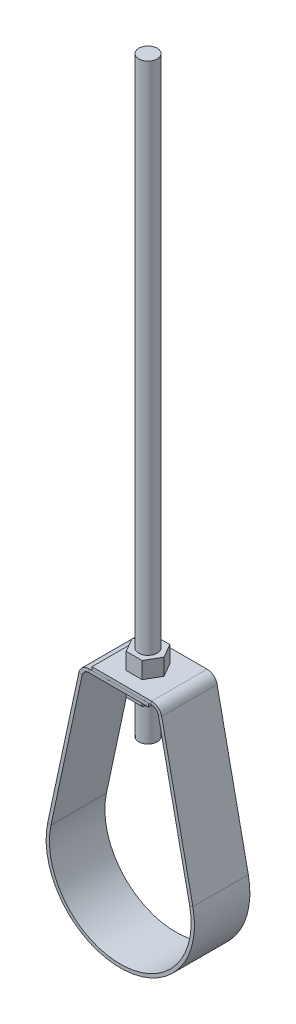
ISO-10303-21;
HEADER;
FILE_DESCRIPTION(('STEP AP214'),'2;1');
FILE_NAME('part.step','',(''),(''),'','','');
FILE_SCHEMA(('AUTOMOTIVE_DESIGN { 1 0 10303 214 1 1 1 1 }'));
ENDSEC;
DATA;
#1=APPLICATION_CONTEXT('core data for automotive mechanical design processes');
#2=APPLICATION_PROTOCOL_DEFINITION('international standard','automotive_design',2000,#1);
#3=PRODUCT_CONTEXT('',#1,'mechanical');
#4=PRODUCT('Part','Part','',(#3));
#5=PRODUCT_RELATED_PRODUCT_CATEGORY('part','',(#4));
#6=PRODUCT_DEFINITION_FORMATION('','',#4);
#7=PRODUCT_DEFINITION_CONTEXT('part definition',#1,'design');
#8=PRODUCT_DEFINITION('design','',#6,#7);
#9=PRODUCT_DEFINITION_SHAPE('','',#8);
#10=(LENGTH_UNIT() NAMED_UNIT(*) SI_UNIT(.MILLI.,.METRE.));
#11=(NAMED_UNIT(*) PLANE_ANGLE_UNIT() SI_UNIT($,.RADIAN.));
#12=(NAMED_UNIT(*) SI_UNIT($,.STERADIAN.) SOLID_ANGLE_UNIT());
#13=UNCERTAINTY_MEASURE_WITH_UNIT(LENGTH_MEASURE(1.E-05),#10,'distance_accuracy_value','');
#14=(GEOMETRIC_REPRESENTATION_CONTEXT(3) GLOBAL_UNCERTAINTY_ASSIGNED_CONTEXT((#13)) GLOBAL_UNIT_ASSIGNED_CONTEXT((#10,
#11,#12)) REPRESENTATION_CONTEXT('',''));
#15=CARTESIAN_POINT('',(0.,0.,0.));
#16=DIRECTION('',(0.,0.,1.));
#17=DIRECTION('',(1.,0.,0.));
#18=AXIS2_PLACEMENT_3D('',#15,#16,#17);
#19=CARTESIAN_POINT('',(0.,362.66628,0.));
#20=DIRECTION('',(0.,1.,0.));
#21=DIRECTION('',(0.,0.,1.));
#22=AXIS2_PLACEMENT_3D('',#19,#20,#21);
#23=PLANE('',#22);
#24=CARTESIAN_POINT('',(0.,362.66628,0.));
#25=DIRECTION('',(0.,-1.,0.));
#26=DIRECTION('',(0.,0.,-1.));
#27=AXIS2_PLACEMENT_3D('',#24,#25,#26);
#28=CIRCLE('',#27,4.7625);
#29=CARTESIAN_POINT('',(0.,362.66628,-4.7625));
#30=VERTEX_POINT('',#29);
#31=EDGE_CURVE('E11',#30,#30,#28,.T.);
#32=ORIENTED_EDGE('',*,*,#31,.F.);
#33=EDGE_LOOP('',(#32));
#34=FACE_BOUND('',#33,.T.);
#35=ADVANCED_FACE('F47',(#34),#23,.T.);
#36=CARTESIAN_POINT('',(0.,0.,0.));
#37=DIRECTION('',(0.,-1.,0.));
#38=DIRECTION('',(0.,0.,-1.));
#39=AXIS2_PLACEMENT_3D('',#36,#37,#38);
#40=CYLINDRICAL_SURFACE('',#39,4.7625);
#41=ORIENTED_EDGE('',*,*,#31,.T.);
#42=EDGE_LOOP('',(#41));
#43=FACE_BOUND('',#42,.T.);
#44=CARTESIAN_POINT('',(0.,57.86628,0.));
#45=DIRECTION('',(0.,-1.,0.));
#46=DIRECTION('',(0.,0.,-1.));
#47=AXIS2_PLACEMENT_3D('',#44,#45,#46);
#48=CIRCLE('',#47,4.7625);
#49=CARTESIAN_POINT('',(0.,57.86628,-4.7625));
#50=VERTEX_POINT('',#49);
#51=EDGE_CURVE('E53',#50,#50,#48,.T.);
#52=ORIENTED_EDGE('',*,*,#51,.F.);
#53=EDGE_LOOP('',(#52));
#54=FACE_BOUND('',#53,.T.);
#55=ADVANCED_FACE('F61',(#43,#54),#40,.T.);
#56=CARTESIAN_POINT('',(0.,57.86628,0.));
#57=DIRECTION('',(0.,-1.,0.));
#58=DIRECTION('',(0.,0.,-1.));
#59=AXIS2_PLACEMENT_3D('',#56,#57,#58);
#60=PLANE('',#59);
#61=ORIENTED_EDGE('',*,*,#51,.T.);
#62=EDGE_LOOP('',(#61));
#63=FACE_BOUND('',#62,.T.);
#64=ADVANCED_FACE('F59',(#63),#60,.T.);
#65=CLOSED_SHELL('',(#35,#55,#64));
#66=MANIFOLD_SOLID_BREP('B2',#65);
#67=CARTESIAN_POINT('',(8.24155962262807,85.47608,0.));
#68=DIRECTION('',(0.,1.,0.));
#69=DIRECTION('',(0.,0.,1.));
#70=AXIS2_PLACEMENT_3D('',#67,#68,#69);
#71=PLANE('',#70);
#72=DIRECTION('',(0.5,0.,-0.866025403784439));
#73=VECTOR('',#72,1.);
#74=CARTESIAN_POINT('',(4.12077981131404,85.47608,7.1374));
#75=LINE('',#74,#73);
#76=CARTESIAN_POINT('',(4.12077981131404,85.47608,7.1374));
#77=VERTEX_POINT('',#76);
#78=CARTESIAN_POINT('',(8.24155962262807,85.47608,0.));
#79=VERTEX_POINT('',#78);
#80=EDGE_CURVE('E208',#77,#79,#75,.T.);
#81=ORIENTED_EDGE('',*,*,#80,.T.);
#82=DIRECTION('',(-0.5,0.,-0.866025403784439));
#83=VECTOR('',#82,1.);
#84=CARTESIAN_POINT('',(8.24155962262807,85.47608,0.));
#85=LINE('',#84,#83);
#86=CARTESIAN_POINT('',(4.12077981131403,85.47608,-7.1374));
#87=VERTEX_POINT('',#86);
#88=EDGE_CURVE('E166',#79,#87,#85,.T.);
#89=ORIENTED_EDGE('',*,*,#88,.T.);
#90=DIRECTION('',(-1.,0.,0.));
#91=VECTOR('',#90,1.);
#92=CARTESIAN_POINT('',(4.12077981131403,85.47608,-7.1374));
#93=LINE('',#92,#91);
#94=CARTESIAN_POINT('',(-4.12077981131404,85.47608,-7.1374));
#95=VERTEX_POINT('',#94);
#96=EDGE_CURVE('E179',#87,#95,#93,.T.);
#97=ORIENTED_EDGE('',*,*,#96,.T.);
#98=DIRECTION('',(-0.5,0.,0.866025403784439));
#99=VECTOR('',#98,1.);
#100=CARTESIAN_POINT('',(-4.12077981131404,85.47608,-7.1374));
#101=LINE('',#100,#99);
#102=CARTESIAN_POINT('',(-8.24155962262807,85.47608,0.));
#103=VERTEX_POINT('',#102);
#104=EDGE_CURVE('E173',#95,#103,#101,.T.);
#105=ORIENTED_EDGE('',*,*,#104,.T.);
#106=DIRECTION('',(0.5,0.,0.866025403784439));
#107=VECTOR('',#106,1.);
#108=CARTESIAN_POINT('',(-8.24155962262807,85.47608,0.));
#109=LINE('',#108,#107);
#110=CARTESIAN_POINT('',(-4.12077981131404,85.47608,7.1374));
#111=VERTEX_POINT('',#110);
#112=EDGE_CURVE('E177',#103,#111,#109,.T.);
#113=ORIENTED_EDGE('',*,*,#112,.T.);
#114=DIRECTION('',(1.,0.,0.));
#115=VECTOR('',#114,1.);
#116=CARTESIAN_POINT('',(-4.12077981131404,85.47608,7.1374));
#117=LINE('',#116,#115);
#118=EDGE_CURVE('E129',#111,#77,#117,.T.);
#119=ORIENTED_EDGE('',*,*,#118,.T.);
#120=EDGE_LOOP('',(#81,#89,#97,#105,#113,#119));
#121=FACE_BOUND('',#120,.T.);
#122=CARTESIAN_POINT('',(0.,85.47608,0.));
#123=DIRECTION('',(0.,1.,0.));
#124=DIRECTION('',(0.,0.,1.));
#125=AXIS2_PLACEMENT_3D('',#122,#123,#124);
#126=CIRCLE('',#125,3.96875);
#127=CARTESIAN_POINT('',(0.,85.47608,3.96875));
#128=VERTEX_POINT('',#127);
#129=EDGE_CURVE('E201',#128,#128,#126,.T.);
#130=ORIENTED_EDGE('',*,*,#129,.F.);
#131=EDGE_LOOP('',(#130));
#132=FACE_BOUND('',#131,.T.);
#133=ADVANCED_FACE('F112',(#121,#132),#71,.T.);
#134=CARTESIAN_POINT('',(8.24155962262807,76.91628,0.));
#135=DIRECTION('',(0.,1.,0.));
#136=DIRECTION('',(0.,0.,1.));
#137=AXIS2_PLACEMENT_3D('',#134,#135,#136);
#138=PLANE('',#137);
#139=DIRECTION('',(0.5,0.,-0.866025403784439));
#140=VECTOR('',#139,1.);
#141=CARTESIAN_POINT('',(4.12077981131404,76.91628,7.1374));
#142=LINE('',#141,#140);
#143=CARTESIAN_POINT('',(4.12077981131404,76.91628,7.1374));
#144=VERTEX_POINT('',#143);
#145=CARTESIAN_POINT('',(8.24155962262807,76.91628,0.));
#146=VERTEX_POINT('',#145);
#147=EDGE_CURVE('E197',#144,#146,#142,.T.);
#148=ORIENTED_EDGE('',*,*,#147,.F.);
#149=DIRECTION('',(1.,0.,0.));
#150=VECTOR('',#149,1.);
#151=CARTESIAN_POINT('',(-4.12077981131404,76.91628,7.1374));
#152=LINE('',#151,#150);
#153=CARTESIAN_POINT('',(-4.12077981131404,76.91628,7.1374));
#154=VERTEX_POINT('',#153);
#155=EDGE_CURVE('E158',#154,#144,#152,.T.);
#156=ORIENTED_EDGE('',*,*,#155,.F.);
#157=DIRECTION('',(0.5,0.,0.866025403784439));
#158=VECTOR('',#157,1.);
#159=CARTESIAN_POINT('',(-8.24155962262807,76.91628,0.));
#160=LINE('',#159,#158);
#161=CARTESIAN_POINT('',(-8.24155962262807,76.91628,0.));
#162=VERTEX_POINT('',#161);
#163=EDGE_CURVE('E152',#162,#154,#160,.T.);
#164=ORIENTED_EDGE('',*,*,#163,.F.);
#165=DIRECTION('',(-0.5,0.,0.866025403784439));
#166=VECTOR('',#165,1.);
#167=CARTESIAN_POINT('',(-4.12077981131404,76.91628,-7.1374));
#168=LINE('',#167,#166);
#169=CARTESIAN_POINT('',(-4.12077981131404,76.91628,-7.1374));
#170=VERTEX_POINT('',#169);
#171=EDGE_CURVE('E187',#170,#162,#168,.T.);
#172=ORIENTED_EDGE('',*,*,#171,.F.);
#173=DIRECTION('',(-1.,0.,0.));
#174=VECTOR('',#173,1.);
#175=CARTESIAN_POINT('',(4.12077981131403,76.91628,-7.1374));
#176=LINE('',#175,#174);
#177=CARTESIAN_POINT('',(4.12077981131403,76.91628,-7.1374));
#178=VERTEX_POINT('',#177);
#179=EDGE_CURVE('E203',#178,#170,#176,.T.);
#180=ORIENTED_EDGE('',*,*,#179,.F.);
#181=DIRECTION('',(-0.5,0.,-0.866025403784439));
#182=VECTOR('',#181,1.);
#183=CARTESIAN_POINT('',(8.24155962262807,76.91628,0.));
#184=LINE('',#183,#182);
#185=EDGE_CURVE('E200',#146,#178,#184,.T.);
#186=ORIENTED_EDGE('',*,*,#185,.F.);
#187=EDGE_LOOP('',(#148,#156,#164,#172,#180,#186));
#188=FACE_BOUND('',#187,.T.);
#189=CARTESIAN_POINT('',(0.,76.91628,0.));
#190=DIRECTION('',(0.,1.,0.));
#191=DIRECTION('',(0.,0.,1.));
#192=AXIS2_PLACEMENT_3D('',#189,#190,#191);
#193=CIRCLE('',#192,3.96875);
#194=CARTESIAN_POINT('',(0.,76.91628,3.96875));
#195=VERTEX_POINT('',#194);
#196=EDGE_CURVE('E301',#195,#195,#193,.T.);
#197=ORIENTED_EDGE('',*,*,#196,.T.);
#198=EDGE_LOOP('',(#197));
#199=FACE_BOUND('',#198,.T.);
#200=ADVANCED_FACE('F217',(#188,#199),#138,.F.);
#201=CARTESIAN_POINT('',(4.12077981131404,85.47608,7.1374));
#202=DIRECTION('',(-0.866025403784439,0.,-0.5));
#203=DIRECTION('',(-0.5,0.,0.866025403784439));
#204=AXIS2_PLACEMENT_3D('',#201,#202,#203);
#205=PLANE('',#204);
#206=ORIENTED_EDGE('',*,*,#147,.T.);
#207=DIRECTION('',(0.,-1.,0.));
#208=VECTOR('',#207,1.);
#209=CARTESIAN_POINT('',(8.24155962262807,85.47608,0.));
#210=LINE('',#209,#208);
#211=EDGE_CURVE('E45',#79,#146,#210,.T.);
#212=ORIENTED_EDGE('',*,*,#211,.F.);
#213=ORIENTED_EDGE('',*,*,#80,.F.);
#214=DIRECTION('',(0.,-1.,0.));
#215=VECTOR('',#214,1.);
#216=CARTESIAN_POINT('',(4.12077981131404,85.47608,7.1374));
#217=LINE('',#216,#215);
#218=EDGE_CURVE('E193',#77,#144,#217,.T.);
#219=ORIENTED_EDGE('',*,*,#218,.T.);
#220=EDGE_LOOP('',(#206,#212,#213,#219));
#221=FACE_BOUND('',#220,.T.);
#222=ADVANCED_FACE('F114',(#221),#205,.F.);
#223=CARTESIAN_POINT('',(8.24155962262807,85.47608,0.));
#224=DIRECTION('',(-0.866025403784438,0.,0.5));
#225=DIRECTION('',(0.5,0.,0.866025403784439));
#226=AXIS2_PLACEMENT_3D('',#223,#224,#225);
#227=PLANE('',#226);
#228=ORIENTED_EDGE('',*,*,#185,.T.);
#229=DIRECTION('',(0.,-1.,0.));
#230=VECTOR('',#229,1.);
#231=CARTESIAN_POINT('',(4.12077981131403,85.47608,-7.1374));
#232=LINE('',#231,#230);
#233=EDGE_CURVE('E121',#87,#178,#232,.T.);
#234=ORIENTED_EDGE('',*,*,#233,.F.);
#235=ORIENTED_EDGE('',*,*,#88,.F.);
#236=ORIENTED_EDGE('',*,*,#211,.T.);
#237=EDGE_LOOP('',(#228,#234,#235,#236));
#238=FACE_BOUND('',#237,.T.);
#239=ADVANCED_FACE('F242',(#238),#227,.F.);
#240=CARTESIAN_POINT('',(4.12077981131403,85.47608,-7.1374));
#241=DIRECTION('',(0.,0.,1.));
#242=DIRECTION('',(1.,0.,0.));
#243=AXIS2_PLACEMENT_3D('',#240,#241,#242);
#244=PLANE('',#243);
#245=ORIENTED_EDGE('',*,*,#179,.T.);
#246=DIRECTION('',(0.,-1.,0.));
#247=VECTOR('',#246,1.);
#248=CARTESIAN_POINT('',(-4.12077981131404,85.47608,-7.1374));
#249=LINE('',#248,#247);
#250=EDGE_CURVE('E188',#95,#170,#249,.T.);
#251=ORIENTED_EDGE('',*,*,#250,.F.);
#252=ORIENTED_EDGE('',*,*,#96,.F.);
#253=ORIENTED_EDGE('',*,*,#233,.T.);
#254=EDGE_LOOP('',(#245,#251,#252,#253));
#255=FACE_BOUND('',#254,.T.);
#256=ADVANCED_FACE('F214',(#255),#244,.F.);
#257=CARTESIAN_POINT('',(-4.12077981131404,85.47608,-7.1374));
#258=DIRECTION('',(0.866025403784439,0.,0.5));
#259=DIRECTION('',(0.5,0.,-0.866025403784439));
#260=AXIS2_PLACEMENT_3D('',#257,#258,#259);
#261=PLANE('',#260);
#262=ORIENTED_EDGE('',*,*,#171,.T.);
#263=DIRECTION('',(0.,-1.,0.));
#264=VECTOR('',#263,1.);
#265=CARTESIAN_POINT('',(-8.24155962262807,85.47608,0.));
#266=LINE('',#265,#264);
#267=EDGE_CURVE('E184',#103,#162,#266,.T.);
#268=ORIENTED_EDGE('',*,*,#267,.F.);
#269=ORIENTED_EDGE('',*,*,#104,.F.);
#270=ORIENTED_EDGE('',*,*,#250,.T.);
#271=EDGE_LOOP('',(#262,#268,#269,#270));
#272=FACE_BOUND('',#271,.T.);
#273=ADVANCED_FACE('F185',(#272),#261,.F.);
#274=CARTESIAN_POINT('',(-8.24155962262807,85.47608,0.));
#275=DIRECTION('',(0.866025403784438,0.,-0.5));
#276=DIRECTION('',(-0.5,0.,-0.866025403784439));
#277=AXIS2_PLACEMENT_3D('',#274,#275,#276);
#278=PLANE('',#277);
#279=ORIENTED_EDGE('',*,*,#163,.T.);
#280=DIRECTION('',(0.,-1.,0.));
#281=VECTOR('',#280,1.);
#282=CARTESIAN_POINT('',(-4.12077981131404,85.47608,7.1374));
#283=LINE('',#282,#281);
#284=EDGE_CURVE('E189',#111,#154,#283,.T.);
#285=ORIENTED_EDGE('',*,*,#284,.F.);
#286=ORIENTED_EDGE('',*,*,#112,.F.);
#287=ORIENTED_EDGE('',*,*,#267,.T.);
#288=EDGE_LOOP('',(#279,#285,#286,#287));
#289=FACE_BOUND('',#288,.T.);
#290=ADVANCED_FACE('F191',(#289),#278,.F.);
#291=CARTESIAN_POINT('',(-4.12077981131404,85.47608,7.1374));
#292=DIRECTION('',(0.,0.,-1.));
#293=DIRECTION('',(-1.,0.,0.));
#294=AXIS2_PLACEMENT_3D('',#291,#292,#293);
#295=PLANE('',#294);
#296=ORIENTED_EDGE('',*,*,#155,.T.);
#297=ORIENTED_EDGE('',*,*,#218,.F.);
#298=ORIENTED_EDGE('',*,*,#118,.F.);
#299=ORIENTED_EDGE('',*,*,#284,.T.);
#300=EDGE_LOOP('',(#296,#297,#298,#299));
#301=FACE_BOUND('',#300,.T.);
#302=ADVANCED_FACE('F222',(#301),#295,.F.);
#303=CARTESIAN_POINT('',(0.,85.47608,0.));
#304=DIRECTION('',(0.,-1.,0.));
#305=DIRECTION('',(0.,0.,-1.));
#306=AXIS2_PLACEMENT_3D('',#303,#304,#305);
#307=CYLINDRICAL_SURFACE('',#306,3.96875);
#308=ORIENTED_EDGE('',*,*,#129,.T.);
#309=EDGE_LOOP('',(#308));
#310=FACE_BOUND('',#309,.T.);
#311=ORIENTED_EDGE('',*,*,#196,.F.);
#312=EDGE_LOOP('',(#311));
#313=FACE_BOUND('',#312,.T.);
#314=ADVANCED_FACE('F224',(#310,#313),#307,.F.);
#315=CLOSED_SHELL('',(#133,#200,#222,#239,#256,#273,#290,#302,#314));
#316=MANIFOLD_SOLID_BREP('B6',#315);
#317=CARTESIAN_POINT('',(8.24155962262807,97.45726,0.));
#318=DIRECTION('',(0.,1.,0.));
#319=DIRECTION('',(0.,0.,1.));
#320=AXIS2_PLACEMENT_3D('',#317,#318,#319);
#321=PLANE('',#320);
#322=DIRECTION('',(0.5,0.,-0.866025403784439));
#323=VECTOR('',#322,1.);
#324=CARTESIAN_POINT('',(4.12077981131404,97.45726,7.1374));
#325=LINE('',#324,#323);
#326=CARTESIAN_POINT('',(4.12077981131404,97.45726,7.1374));
#327=VERTEX_POINT('',#326);
#328=CARTESIAN_POINT('',(8.24155962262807,97.45726,0.));
#329=VERTEX_POINT('',#328);
#330=EDGE_CURVE('E413',#327,#329,#325,.T.);
#331=ORIENTED_EDGE('',*,*,#330,.T.);
#332=DIRECTION('',(-0.5,0.,-0.866025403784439));
#333=VECTOR('',#332,1.);
#334=CARTESIAN_POINT('',(8.24155962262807,97.45726,0.));
#335=LINE('',#334,#333);
#336=CARTESIAN_POINT('',(4.12077981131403,97.45726,-7.1374));
#337=VERTEX_POINT('',#336);
#338=EDGE_CURVE('E371',#329,#337,#335,.T.);
#339=ORIENTED_EDGE('',*,*,#338,.T.);
#340=DIRECTION('',(-1.,0.,0.));
#341=VECTOR('',#340,1.);
#342=CARTESIAN_POINT('',(4.12077981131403,97.45726,-7.1374));
#343=LINE('',#342,#341);
#344=CARTESIAN_POINT('',(-4.12077981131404,97.45726,-7.1374));
#345=VERTEX_POINT('',#344);
#346=EDGE_CURVE('E384',#337,#345,#343,.T.);
#347=ORIENTED_EDGE('',*,*,#346,.T.);
#348=DIRECTION('',(-0.5,0.,0.866025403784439));
#349=VECTOR('',#348,1.);
#350=CARTESIAN_POINT('',(-4.12077981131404,97.45726,-7.1374));
#351=LINE('',#350,#349);
#352=CARTESIAN_POINT('',(-8.24155962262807,97.45726,0.));
#353=VERTEX_POINT('',#352);
#354=EDGE_CURVE('E378',#345,#353,#351,.T.);
#355=ORIENTED_EDGE('',*,*,#354,.T.);
#356=DIRECTION('',(0.5,0.,0.866025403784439));
#357=VECTOR('',#356,1.);
#358=CARTESIAN_POINT('',(-8.24155962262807,97.45726,0.));
#359=LINE('',#358,#357);
#360=CARTESIAN_POINT('',(-4.12077981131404,97.45726,7.1374));
#361=VERTEX_POINT('',#360);
#362=EDGE_CURVE('E382',#353,#361,#359,.T.);
#363=ORIENTED_EDGE('',*,*,#362,.T.);
#364=DIRECTION('',(1.,0.,0.));
#365=VECTOR('',#364,1.);
#366=CARTESIAN_POINT('',(-4.12077981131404,97.45726,7.1374));
#367=LINE('',#366,#365);
#368=EDGE_CURVE('E334',#361,#327,#367,.T.);
#369=ORIENTED_EDGE('',*,*,#368,.T.);
#370=EDGE_LOOP('',(#331,#339,#347,#355,#363,#369));
#371=FACE_BOUND('',#370,.T.);
#372=CARTESIAN_POINT('',(0.,97.45726,0.));
#373=DIRECTION('',(0.,1.,0.));
#374=DIRECTION('',(0.,0.,1.));
#375=AXIS2_PLACEMENT_3D('',#372,#373,#374);
#376=CIRCLE('',#375,3.96875);
#377=CARTESIAN_POINT('',(0.,97.45726,3.96875));
#378=VERTEX_POINT('',#377);
#379=EDGE_CURVE('E406',#378,#378,#376,.T.);
#380=ORIENTED_EDGE('',*,*,#379,.F.);
#381=EDGE_LOOP('',(#380));
#382=FACE_BOUND('',#381,.T.);
#383=ADVANCED_FACE('F317',(#371,#382),#321,.T.);
#384=CARTESIAN_POINT('',(8.24155962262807,88.89746,0.));
#385=DIRECTION('',(0.,1.,0.));
#386=DIRECTION('',(0.,0.,1.));
#387=AXIS2_PLACEMENT_3D('',#384,#385,#386);
#388=PLANE('',#387);
#389=DIRECTION('',(0.5,0.,-0.866025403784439));
#390=VECTOR('',#389,1.);
#391=CARTESIAN_POINT('',(4.12077981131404,88.89746,7.1374));
#392=LINE('',#391,#390);
#393=CARTESIAN_POINT('',(4.12077981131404,88.89746,7.1374));
#394=VERTEX_POINT('',#393);
#395=CARTESIAN_POINT('',(8.24155962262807,88.89746,0.));
#396=VERTEX_POINT('',#395);
#397=EDGE_CURVE('E402',#394,#396,#392,.T.);
#398=ORIENTED_EDGE('',*,*,#397,.F.);
#399=DIRECTION('',(1.,0.,0.));
#400=VECTOR('',#399,1.);
#401=CARTESIAN_POINT('',(-4.12077981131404,88.89746,7.1374));
#402=LINE('',#401,#400);
#403=CARTESIAN_POINT('',(-4.12077981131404,88.89746,7.1374));
#404=VERTEX_POINT('',#403);
#405=EDGE_CURVE('E363',#404,#394,#402,.T.);
#406=ORIENTED_EDGE('',*,*,#405,.F.);
#407=DIRECTION('',(0.5,0.,0.866025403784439));
#408=VECTOR('',#407,1.);
#409=CARTESIAN_POINT('',(-8.24155962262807,88.89746,0.));
#410=LINE('',#409,#408);
#411=CARTESIAN_POINT('',(-8.24155962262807,88.89746,0.));
#412=VERTEX_POINT('',#411);
#413=EDGE_CURVE('E357',#412,#404,#410,.T.);
#414=ORIENTED_EDGE('',*,*,#413,.F.);
#415=DIRECTION('',(-0.5,0.,0.866025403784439));
#416=VECTOR('',#415,1.);
#417=CARTESIAN_POINT('',(-4.12077981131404,88.89746,-7.1374));
#418=LINE('',#417,#416);
#419=CARTESIAN_POINT('',(-4.12077981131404,88.89746,-7.1374));
#420=VERTEX_POINT('',#419);
#421=EDGE_CURVE('E392',#420,#412,#418,.T.);
#422=ORIENTED_EDGE('',*,*,#421,.F.);
#423=DIRECTION('',(-1.,0.,0.));
#424=VECTOR('',#423,1.);
#425=CARTESIAN_POINT('',(4.12077981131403,88.89746,-7.1374));
#426=LINE('',#425,#424);
#427=CARTESIAN_POINT('',(4.12077981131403,88.89746,-7.1374));
#428=VERTEX_POINT('',#427);
#429=EDGE_CURVE('E408',#428,#420,#426,.T.);
#430=ORIENTED_EDGE('',*,*,#429,.F.);
#431=DIRECTION('',(-0.5,0.,-0.866025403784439));
#432=VECTOR('',#431,1.);
#433=CARTESIAN_POINT('',(8.24155962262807,88.89746,0.));
#434=LINE('',#433,#432);
#435=EDGE_CURVE('E405',#396,#428,#434,.T.);
#436=ORIENTED_EDGE('',*,*,#435,.F.);
#437=EDGE_LOOP('',(#398,#406,#414,#422,#430,#436));
#438=FACE_BOUND('',#437,.T.);
#439=CARTESIAN_POINT('',(0.,88.89746,0.));
#440=DIRECTION('',(0.,1.,0.));
#441=DIRECTION('',(0.,0.,1.));
#442=AXIS2_PLACEMENT_3D('',#439,#440,#441);
#443=CIRCLE('',#442,3.96875);
#444=CARTESIAN_POINT('',(0.,88.89746,3.96875));
#445=VERTEX_POINT('',#444);
#446=EDGE_CURVE('E506',#445,#445,#443,.T.);
#447=ORIENTED_EDGE('',*,*,#446,.T.);
#448=EDGE_LOOP('',(#447));
#449=FACE_BOUND('',#448,.T.);
#450=ADVANCED_FACE('F422',(#438,#449),#388,.F.);
#451=CARTESIAN_POINT('',(4.12077981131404,97.45726,7.1374));
#452=DIRECTION('',(-0.866025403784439,0.,-0.5));
#453=DIRECTION('',(-0.5,0.,0.866025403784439));
#454=AXIS2_PLACEMENT_3D('',#451,#452,#453);
#455=PLANE('',#454);
#456=ORIENTED_EDGE('',*,*,#397,.T.);
#457=DIRECTION('',(0.,-1.,0.));
#458=VECTOR('',#457,1.);
#459=CARTESIAN_POINT('',(8.24155962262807,97.45726,0.));
#460=LINE('',#459,#458);
#461=EDGE_CURVE('E110',#329,#396,#460,.T.);
#462=ORIENTED_EDGE('',*,*,#461,.F.);
#463=ORIENTED_EDGE('',*,*,#330,.F.);
#464=DIRECTION('',(0.,-1.,0.));
#465=VECTOR('',#464,1.);
#466=CARTESIAN_POINT('',(4.12077981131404,97.45726,7.1374));
#467=LINE('',#466,#465);
#468=EDGE_CURVE('E398',#327,#394,#467,.T.);
#469=ORIENTED_EDGE('',*,*,#468,.T.);
#470=EDGE_LOOP('',(#456,#462,#463,#469));
#471=FACE_BOUND('',#470,.T.);
#472=ADVANCED_FACE('F319',(#471),#455,.F.);
#473=CARTESIAN_POINT('',(8.24155962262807,97.45726,0.));
#474=DIRECTION('',(-0.866025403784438,0.,0.5));
#475=DIRECTION('',(0.5,0.,0.866025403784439));
#476=AXIS2_PLACEMENT_3D('',#473,#474,#475);
#477=PLANE('',#476);
#478=ORIENTED_EDGE('',*,*,#435,.T.);
#479=DIRECTION('',(0.,-1.,0.));
#480=VECTOR('',#479,1.);
#481=CARTESIAN_POINT('',(4.12077981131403,97.45726,-7.1374));
#482=LINE('',#481,#480);
#483=EDGE_CURVE('E326',#337,#428,#482,.T.);
#484=ORIENTED_EDGE('',*,*,#483,.F.);
#485=ORIENTED_EDGE('',*,*,#338,.F.);
#486=ORIENTED_EDGE('',*,*,#461,.T.);
#487=EDGE_LOOP('',(#478,#484,#485,#486));
#488=FACE_BOUND('',#487,.T.);
#489=ADVANCED_FACE('F447',(#488),#477,.F.);
#490=CARTESIAN_POINT('',(4.12077981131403,97.45726,-7.1374));
#491=DIRECTION('',(0.,0.,1.));
#492=DIRECTION('',(1.,0.,0.));
#493=AXIS2_PLACEMENT_3D('',#490,#491,#492);
#494=PLANE('',#493);
#495=ORIENTED_EDGE('',*,*,#429,.T.);
#496=DIRECTION('',(0.,-1.,0.));
#497=VECTOR('',#496,1.);
#498=CARTESIAN_POINT('',(-4.12077981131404,97.45726,-7.1374));
#499=LINE('',#498,#497);
#500=EDGE_CURVE('E393',#345,#420,#499,.T.);
#501=ORIENTED_EDGE('',*,*,#500,.F.);
#502=ORIENTED_EDGE('',*,*,#346,.F.);
#503=ORIENTED_EDGE('',*,*,#483,.T.);
#504=EDGE_LOOP('',(#495,#501,#502,#503));
#505=FACE_BOUND('',#504,.T.);
#506=ADVANCED_FACE('F419',(#505),#494,.F.);
#507=CARTESIAN_POINT('',(-4.12077981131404,97.45726,-7.1374));
#508=DIRECTION('',(0.866025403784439,0.,0.5));
#509=DIRECTION('',(0.5,0.,-0.866025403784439));
#510=AXIS2_PLACEMENT_3D('',#507,#508,#509);
#511=PLANE('',#510);
#512=ORIENTED_EDGE('',*,*,#421,.T.);
#513=DIRECTION('',(0.,-1.,0.));
#514=VECTOR('',#513,1.);
#515=CARTESIAN_POINT('',(-8.24155962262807,97.45726,0.));
#516=LINE('',#515,#514);
#517=EDGE_CURVE('E389',#353,#412,#516,.T.);
#518=ORIENTED_EDGE('',*,*,#517,.F.);
#519=ORIENTED_EDGE('',*,*,#354,.F.);
#520=ORIENTED_EDGE('',*,*,#500,.T.);
#521=EDGE_LOOP('',(#512,#518,#519,#520));
#522=FACE_BOUND('',#521,.T.);
#523=ADVANCED_FACE('F390',(#522),#511,.F.);
#524=CARTESIAN_POINT('',(-8.24155962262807,97.45726,0.));
#525=DIRECTION('',(0.866025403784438,0.,-0.5));
#526=DIRECTION('',(-0.5,0.,-0.866025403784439));
#527=AXIS2_PLACEMENT_3D('',#524,#525,#526);
#528=PLANE('',#527);
#529=ORIENTED_EDGE('',*,*,#413,.T.);
#530=DIRECTION('',(0.,-1.,0.));
#531=VECTOR('',#530,1.);
#532=CARTESIAN_POINT('',(-4.12077981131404,97.45726,7.1374));
#533=LINE('',#532,#531);
#534=EDGE_CURVE('E394',#361,#404,#533,.T.);
#535=ORIENTED_EDGE('',*,*,#534,.F.);
#536=ORIENTED_EDGE('',*,*,#362,.F.);
#537=ORIENTED_EDGE('',*,*,#517,.T.);
#538=EDGE_LOOP('',(#529,#535,#536,#537));
#539=FACE_BOUND('',#538,.T.);
#540=ADVANCED_FACE('F396',(#539),#528,.F.);
#541=CARTESIAN_POINT('',(-4.12077981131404,97.45726,7.1374));
#542=DIRECTION('',(0.,0.,-1.));
#543=DIRECTION('',(-1.,0.,0.));
#544=AXIS2_PLACEMENT_3D('',#541,#542,#543);
#545=PLANE('',#544);
#546=ORIENTED_EDGE('',*,*,#405,.T.);
#547=ORIENTED_EDGE('',*,*,#468,.F.);
#548=ORIENTED_EDGE('',*,*,#368,.F.);
#549=ORIENTED_EDGE('',*,*,#534,.T.);
#550=EDGE_LOOP('',(#546,#547,#548,#549));
#551=FACE_BOUND('',#550,.T.);
#552=ADVANCED_FACE('F427',(#551),#545,.F.);
#553=CARTESIAN_POINT('',(0.,97.45726,0.));
#554=DIRECTION('',(0.,-1.,0.));
#555=DIRECTION('',(0.,0.,-1.));
#556=AXIS2_PLACEMENT_3D('',#553,#554,#555);
#557=CYLINDRICAL_SURFACE('',#556,3.96875);
#558=ORIENTED_EDGE('',*,*,#379,.T.);
#559=EDGE_LOOP('',(#558));
#560=FACE_BOUND('',#559,.T.);
#561=ORIENTED_EDGE('',*,*,#446,.F.);
#562=EDGE_LOOP('',(#561));
#563=FACE_BOUND('',#562,.T.);
#564=ADVANCED_FACE('F429',(#560,#563),#557,.F.);
#565=CLOSED_SHELL('',(#383,#450,#472,#489,#506,#523,#540,#552,#564));
#566=MANIFOLD_SOLID_BREP('B39',#565);
#567=CARTESIAN_POINT('',(-19.05,85.47608,14.2875));
#568=DIRECTION('',(0.,1.,0.));
#569=DIRECTION('',(0.,0.,1.));
#570=AXIS2_PLACEMENT_3D('',#567,#568,#569);
#571=PLANE('',#570);
#572=DIRECTION('',(1.,0.,0.));
#573=VECTOR('',#572,1.);
#574=CARTESIAN_POINT('',(-19.05,85.47608,-14.2875));
#575=LINE('',#574,#573);
#576=CARTESIAN_POINT('',(-16.1743734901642,85.47608,-14.2875));
#577=VERTEX_POINT('',#576);
#578=CARTESIAN_POINT('',(14.605508,85.47608,-14.2875));
#579=VERTEX_POINT('',#578);
#580=EDGE_CURVE('E676',#577,#579,#575,.T.);
#581=ORIENTED_EDGE('',*,*,#580,.T.);
#582=DIRECTION('',(0.,0.,-1.));
#583=VECTOR('',#582,1.);
#584=CARTESIAN_POINT('',(14.605508,85.47608,14.2875));
#585=LINE('',#584,#583);
#586=CARTESIAN_POINT('',(14.605508,85.47608,14.2875));
#587=VERTEX_POINT('',#586);
#588=EDGE_CURVE('E753',#587,#579,#585,.T.);
#589=ORIENTED_EDGE('',*,*,#588,.F.);
#590=DIRECTION('',(1.,0.,0.));
#591=VECTOR('',#590,1.);
#592=CARTESIAN_POINT('',(-19.05,85.47608,14.2875));
#593=LINE('',#592,#591);
#594=CARTESIAN_POINT('',(-16.1743734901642,85.47608,14.2875));
#595=VERTEX_POINT('',#594);
#596=EDGE_CURVE('E597',#595,#587,#593,.T.);
#597=ORIENTED_EDGE('',*,*,#596,.F.);
#598=DIRECTION('',(0.,0.,-1.));
#599=VECTOR('',#598,1.);
#600=CARTESIAN_POINT('',(-16.1743734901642,85.47608,14.2875));
#601=LINE('',#600,#599);
#602=EDGE_CURVE('E672',#595,#577,#601,.T.);
#603=ORIENTED_EDGE('',*,*,#602,.T.);
#604=EDGE_LOOP('',(#581,#589,#597,#603));
#605=FACE_BOUND('',#604,.T.);
#606=CARTESIAN_POINT('',(0.,85.47608,0.));
#607=DIRECTION('',(0.,1.,0.));
#608=DIRECTION('',(0.,0.,1.));
#609=AXIS2_PLACEMENT_3D('',#606,#607,#608);
#610=CIRCLE('',#609,4.9022);
#611=CARTESIAN_POINT('',(0.,85.47608,4.9022));
#612=VERTEX_POINT('',#611);
#613=EDGE_CURVE('E1190',#612,#612,#610,.F.);
#614=ORIENTED_EDGE('',*,*,#613,.F.);
#615=EDGE_LOOP('',(#614));
#616=FACE_BOUND('',#615,.T.);
#617=ADVANCED_FACE('F513',(#605,#616),#571,.F.);
#618=CARTESIAN_POINT('',(35.7376405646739,7.48222581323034,14.2875));
#619=DIRECTION('',(0.,0.,1.));
#620=DIRECTION('',(1.,0.,0.));
#621=AXIS2_PLACEMENT_3D('',#618,#619,#620);
#622=PLANE('',#621);
#623=DIRECTION('',(0.978778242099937,0.204922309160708,0.));
#624=VECTOR('',#623,1.);
#625=CARTESIAN_POINT('',(35.7376405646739,7.48222581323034,14.2875));
#626=LINE('',#625,#624);
#627=CARTESIAN_POINT('',(35.7376405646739,7.48222581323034,14.2875));
#628=VERTEX_POINT('',#627);
#629=CARTESIAN_POINT('',(37.4107836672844,7.83252410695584,14.2875));
#630=VERTEX_POINT('',#629);
#631=EDGE_CURVE('E315',#628,#630,#626,.T.);
#632=ORIENTED_EDGE('',*,*,#631,.F.);
#633=CARTESIAN_POINT('',(0.,0.,14.2875));
#634=DIRECTION('',(0.,0.,-1.));
#635=DIRECTION('',(1.,0.,0.));
#636=AXIS2_PLACEMENT_3D('',#633,#634,#635);
#637=CIRCLE('',#636,36.5125);
#638=CARTESIAN_POINT('',(-35.7043505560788,7.63950310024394,14.2875));
#639=VERTEX_POINT('',#638);
#640=EDGE_CURVE('E650',#628,#639,#637,.T.);
#641=ORIENTED_EDGE('',*,*,#640,.T.);
#642=DIRECTION('',(0.977866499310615,-0.209229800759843,0.));
#643=VECTOR('',#642,1.);
#644=CARTESIAN_POINT('',(-37.3759351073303,7.99716470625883,14.2875));
#645=LINE('',#644,#643);
#646=CARTESIAN_POINT('',(-37.3759351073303,7.99716470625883,14.2875));
#647=VERTEX_POINT('',#646);
#648=EDGE_CURVE('E523',#647,#639,#645,.T.);
#649=ORIENTED_EDGE('',*,*,#648,.F.);
#650=CARTESIAN_POINT('',(0.,0.,14.2875));
#651=DIRECTION('',(0.,0.,1.));
#652=DIRECTION('',(1.,0.,0.));
#653=AXIS2_PLACEMENT_3D('',#650,#651,#652);
#654=CIRCLE('',#653,38.22192);
#655=EDGE_CURVE('E777',#630,#647,#654,.F.);
#656=ORIENTED_EDGE('',*,*,#655,.F.);
#657=EDGE_LOOP('',(#632,#641,#649,#656));
#658=FACE_BOUND('',#657,.T.);
#659=ADVANCED_FACE('F515',(#658),#622,.T.);
#660=CARTESIAN_POINT('',(-37.3759351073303,7.99716470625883,14.2875));
#661=DIRECTION('',(0.,0.,1.));
#662=DIRECTION('',(1.,0.,0.));
#663=AXIS2_PLACEMENT_3D('',#660,#661,#662);
#664=PLANE('',#663);
#665=DIRECTION('',(0.204922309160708,-0.978778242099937,0.));
#666=VECTOR('',#665,1.);
#667=CARTESIAN_POINT('',(19.05,87.18804,14.2875));
#668=LINE('',#667,#666);
#669=CARTESIAN_POINT('',(19.641938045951,84.3607437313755,14.2875));
#670=VERTEX_POINT('',#669);
#671=EDGE_CURVE('E655',#670,#628,#668,.T.);
#672=ORIENTED_EDGE('',*,*,#671,.T.);
#673=ORIENTED_EDGE('',*,*,#631,.T.);
#674=DIRECTION('',(0.204922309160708,-0.978778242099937,0.));
#675=VECTOR('',#674,1.);
#676=CARTESIAN_POINT('',(20.7231431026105,87.5383382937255,14.2875));
#677=LINE('',#676,#675);
#678=CARTESIAN_POINT('',(21.3150811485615,84.711042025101,14.2875));
#679=VERTEX_POINT('',#678);
#680=EDGE_CURVE('E791',#679,#630,#677,.T.);
#681=ORIENTED_EDGE('',*,*,#680,.F.);
#682=DIRECTION('',(-0.978778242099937,-0.20492230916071,0.));
#683=VECTOR('',#682,1.);
#684=CARTESIAN_POINT('',(21.3150811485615,84.711042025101,14.2875));
#685=LINE('',#684,#683);
#686=EDGE_CURVE('E759',#679,#670,#685,.T.);
#687=ORIENTED_EDGE('',*,*,#686,.T.);
#688=EDGE_LOOP('',(#672,#673,#681,#687));
#689=FACE_BOUND('',#688,.T.);
#690=ADVANCED_FACE('F815',(#689),#664,.T.);
#691=CARTESIAN_POINT('',(-35.7043505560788,7.63950310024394,-14.2875));
#692=DIRECTION('',(0.,0.,-1.));
#693=DIRECTION('',(-1.,0.,0.));
#694=AXIS2_PLACEMENT_3D('',#691,#692,#693);
#695=PLANE('',#694);
#696=DIRECTION('',(-0.977866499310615,0.209229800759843,0.));
#697=VECTOR('',#696,1.);
#698=CARTESIAN_POINT('',(-35.7043505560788,7.63950310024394,-14.2875));
#699=LINE('',#698,#697);
#700=CARTESIAN_POINT('',(-35.7043505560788,7.63950310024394,-14.2875));
#701=VERTEX_POINT('',#700);
#702=CARTESIAN_POINT('',(-37.3759351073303,7.99716470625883,-14.2875));
#703=VERTEX_POINT('',#702);
#704=EDGE_CURVE('E647',#701,#703,#699,.T.);
#705=ORIENTED_EDGE('',*,*,#704,.F.);
#706=CARTESIAN_POINT('',(0.,0.,-14.2875));
#707=DIRECTION('',(0.,0.,-1.));
#708=DIRECTION('',(1.,0.,0.));
#709=AXIS2_PLACEMENT_3D('',#706,#707,#708);
#710=CIRCLE('',#709,36.5125);
#711=CARTESIAN_POINT('',(35.7376405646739,7.48222581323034,-14.2875));
#712=VERTEX_POINT('',#711);
#713=EDGE_CURVE('E662',#712,#701,#710,.T.);
#714=ORIENTED_EDGE('',*,*,#713,.F.);
#715=DIRECTION('',(-0.978778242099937,-0.204922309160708,0.));
#716=VECTOR('',#715,1.);
#717=CARTESIAN_POINT('',(37.4107836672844,7.83252410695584,-14.2875));
#718=LINE('',#717,#716);
#719=CARTESIAN_POINT('',(37.4107836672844,7.83252410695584,-14.2875));
#720=VERTEX_POINT('',#719);
#721=EDGE_CURVE('E768',#720,#712,#718,.T.);
#722=ORIENTED_EDGE('',*,*,#721,.F.);
#723=CARTESIAN_POINT('',(0.,0.,-14.2875));
#724=DIRECTION('',(0.,0.,1.));
#725=DIRECTION('',(1.,0.,0.));
#726=AXIS2_PLACEMENT_3D('',#723,#724,#725);
#727=CIRCLE('',#726,38.22192);
#728=EDGE_CURVE('E690',#720,#703,#727,.F.);
#729=ORIENTED_EDGE('',*,*,#728,.T.);
#730=EDGE_LOOP('',(#705,#714,#722,#729));
#731=FACE_BOUND('',#730,.T.);
#732=ADVANCED_FACE('F782',(#731),#695,.T.);
#733=CARTESIAN_POINT('',(37.4107836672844,7.83252410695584,-14.2875));
#734=DIRECTION('',(0.,0.,-1.));
#735=DIRECTION('',(-1.,0.,0.));
#736=AXIS2_PLACEMENT_3D('',#733,#734,#735);
#737=PLANE('',#736);
#738=DIRECTION('',(0.209229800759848,0.977866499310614,0.));
#739=VECTOR('',#738,1.);
#740=CARTESIAN_POINT('',(-19.05,85.47608,-14.2875));
#741=LINE('',#740,#739);
#742=CARTESIAN_POINT('',(-19.6516667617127,82.664101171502,-14.2875));
#743=VERTEX_POINT('',#742);
#744=EDGE_CURVE('E715',#701,#743,#741,.T.);
#745=ORIENTED_EDGE('',*,*,#744,.F.);
#746=ORIENTED_EDGE('',*,*,#704,.T.);
#747=DIRECTION('',(0.209229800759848,0.977866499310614,0.));
#748=VECTOR('',#747,1.);
#749=CARTESIAN_POINT('',(-20.7215845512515,85.8337416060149,-14.2875));
#750=LINE('',#749,#748);
#751=CARTESIAN_POINT('',(-21.3232513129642,83.0217627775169,-14.2875));
#752=VERTEX_POINT('',#751);
#753=EDGE_CURVE('E688',#703,#752,#750,.T.);
#754=ORIENTED_EDGE('',*,*,#753,.T.);
#755=DIRECTION('',(0.977866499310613,-0.209229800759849,0.));
#756=VECTOR('',#755,1.);
#757=CARTESIAN_POINT('',(-21.3232513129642,83.0217627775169,-14.2875));
#758=LINE('',#757,#756);
#759=EDGE_CURVE('E584',#752,#743,#758,.T.);
#760=ORIENTED_EDGE('',*,*,#759,.T.);
#761=EDGE_LOOP('',(#745,#746,#754,#760));
#762=FACE_BOUND('',#761,.T.);
#763=ADVANCED_FACE('F770',(#762),#737,.T.);
#764=CARTESIAN_POINT('',(-19.6516667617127,82.664101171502,14.2875));
#765=DIRECTION('',(0.,0.,1.));
#766=DIRECTION('',(1.,0.,0.));
#767=AXIS2_PLACEMENT_3D('',#764,#765,#766);
#768=PLANE('',#767);
#769=DIRECTION('',(-0.977866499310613,0.209229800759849,0.));
#770=VECTOR('',#769,1.);
#771=CARTESIAN_POINT('',(-19.6516667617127,82.664101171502,14.2875));
#772=LINE('',#771,#770);
#773=CARTESIAN_POINT('',(-19.6516667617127,82.664101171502,14.2875));
#774=VERTEX_POINT('',#773);
#775=CARTESIAN_POINT('',(-21.3232513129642,83.0217627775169,14.2875));
#776=VERTEX_POINT('',#775);
#777=EDGE_CURVE('E766',#774,#776,#772,.T.);
#778=ORIENTED_EDGE('',*,*,#777,.F.);
#779=CARTESIAN_POINT('',(-16.1743734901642,81.92008,14.2875));
#780=DIRECTION('',(0.,0.,-1.));
#781=DIRECTION('',(-1.,0.,0.));
#782=AXIS2_PLACEMENT_3D('',#779,#780,#781);
#783=CIRCLE('',#782,3.556);
#784=EDGE_CURVE('E670',#774,#595,#783,.T.);
#785=ORIENTED_EDGE('',*,*,#784,.T.);
#786=DIRECTION('',(0.,-1.,0.));
#787=VECTOR('',#786,1.);
#788=CARTESIAN_POINT('',(-16.1743734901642,87.1855,14.2875));
#789=LINE('',#788,#787);
#790=CARTESIAN_POINT('',(-16.1743734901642,87.1855,14.2875));
#791=VERTEX_POINT('',#790);
#792=EDGE_CURVE('E531',#791,#595,#789,.T.);
#793=ORIENTED_EDGE('',*,*,#792,.F.);
#794=CARTESIAN_POINT('',(-16.1743734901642,81.92008,14.2875));
#795=DIRECTION('',(0.,0.,1.));
#796=DIRECTION('',(1.,0.,0.));
#797=AXIS2_PLACEMENT_3D('',#794,#795,#796);
#798=CIRCLE('',#797,5.26542);
#799=EDGE_CURVE('E795',#776,#791,#798,.F.);
#800=ORIENTED_EDGE('',*,*,#799,.F.);
#801=EDGE_LOOP('',(#778,#785,#793,#800));
#802=FACE_BOUND('',#801,.T.);
#803=ADVANCED_FACE('F892',(#802),#768,.T.);
#804=CARTESIAN_POINT('',(-16.1743734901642,87.1855,14.2875));
#805=DIRECTION('',(0.,0.,1.));
#806=DIRECTION('',(1.,0.,0.));
#807=AXIS2_PLACEMENT_3D('',#804,#805,#806);
#808=PLANE('',#807);
#809=DIRECTION('',(0.209229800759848,0.977866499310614,0.));
#810=VECTOR('',#809,1.);
#811=CARTESIAN_POINT('',(-19.05,85.47608,14.2875));
#812=LINE('',#811,#810);
#813=EDGE_CURVE('E639',#639,#774,#812,.T.);
#814=ORIENTED_EDGE('',*,*,#813,.T.);
#815=ORIENTED_EDGE('',*,*,#777,.T.);
#816=DIRECTION('',(0.209229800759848,0.977866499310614,0.));
#817=VECTOR('',#816,1.);
#818=CARTESIAN_POINT('',(-20.7215845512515,85.8337416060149,14.2875));
#819=LINE('',#818,#817);
#820=EDGE_CURVE('E642',#647,#776,#819,.T.);
#821=ORIENTED_EDGE('',*,*,#820,.F.);
#822=ORIENTED_EDGE('',*,*,#648,.T.);
#823=EDGE_LOOP('',(#814,#815,#821,#822));
#824=FACE_BOUND('',#823,.T.);
#825=ADVANCED_FACE('F637',(#824),#808,.T.);
#826=CARTESIAN_POINT('',(-16.1743734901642,85.47608,-14.2875));
#827=DIRECTION('',(0.,0.,-1.));
#828=DIRECTION('',(-1.,0.,0.));
#829=AXIS2_PLACEMENT_3D('',#826,#827,#828);
#830=PLANE('',#829);
#831=DIRECTION('',(0.,1.,0.));
#832=VECTOR('',#831,1.);
#833=CARTESIAN_POINT('',(-16.1743734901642,85.47608,-14.2875));
#834=LINE('',#833,#832);
#835=CARTESIAN_POINT('',(-16.1743734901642,87.1855,-14.2875));
#836=VERTEX_POINT('',#835);
#837=EDGE_CURVE('E591',#577,#836,#834,.T.);
#838=ORIENTED_EDGE('',*,*,#837,.F.);
#839=CARTESIAN_POINT('',(-16.1743734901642,81.92008,-14.2875));
#840=DIRECTION('',(0.,0.,-1.));
#841=DIRECTION('',(-1.,0.,0.));
#842=AXIS2_PLACEMENT_3D('',#839,#840,#841);
#843=CIRCLE('',#842,3.556);
#844=EDGE_CURVE('E717',#743,#577,#843,.T.);
#845=ORIENTED_EDGE('',*,*,#844,.F.);
#846=ORIENTED_EDGE('',*,*,#759,.F.);
#847=CARTESIAN_POINT('',(-16.1743734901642,81.92008,-14.2875));
#848=DIRECTION('',(0.,0.,1.));
#849=DIRECTION('',(1.,0.,0.));
#850=AXIS2_PLACEMENT_3D('',#847,#848,#849);
#851=CIRCLE('',#850,5.26542);
#852=EDGE_CURVE('E686',#752,#836,#851,.F.);
#853=ORIENTED_EDGE('',*,*,#852,.T.);
#854=EDGE_LOOP('',(#838,#845,#846,#853));
#855=FACE_BOUND('',#854,.T.);
#856=ADVANCED_FACE('F886',(#855),#830,.T.);
#857=CARTESIAN_POINT('',(-21.3232513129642,83.0217627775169,-14.2875));
#858=DIRECTION('',(0.,0.,-1.));
#859=DIRECTION('',(-1.,0.,0.));
#860=AXIS2_PLACEMENT_3D('',#857,#858,#859);
#861=PLANE('',#860);
#862=ORIENTED_EDGE('',*,*,#580,.F.);
#863=ORIENTED_EDGE('',*,*,#837,.T.);
#864=DIRECTION('',(1.,0.,0.));
#865=VECTOR('',#864,1.);
#866=CARTESIAN_POINT('',(-19.05,87.1855,-14.2875));
#867=LINE('',#866,#865);
#868=CARTESIAN_POINT('',(14.605508,87.1855,-14.2875));
#869=VERTEX_POINT('',#868);
#870=EDGE_CURVE('E683',#836,#869,#867,.T.);
#871=ORIENTED_EDGE('',*,*,#870,.T.);
#872=DIRECTION('',(0.,-1.,0.));
#873=VECTOR('',#872,1.);
#874=CARTESIAN_POINT('',(14.605508,87.1855,-14.2875));
#875=LINE('',#874,#873);
#876=EDGE_CURVE('E679',#869,#579,#875,.T.);
#877=ORIENTED_EDGE('',*,*,#876,.T.);
#878=EDGE_LOOP('',(#862,#863,#871,#877));
#879=FACE_BOUND('',#878,.T.);
#880=ADVANCED_FACE('F883',(#879),#861,.T.);
#881=CARTESIAN_POINT('',(16.1614026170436,87.18804,14.2875));
#882=DIRECTION('',(0.,0.,1.));
#883=DIRECTION('',(1.,0.,0.));
#884=AXIS2_PLACEMENT_3D('',#881,#882,#883);
#885=PLANE('',#884);
#886=DIRECTION('',(0.,1.,0.));
#887=VECTOR('',#886,1.);
#888=CARTESIAN_POINT('',(16.1614026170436,87.18804,14.2875));
#889=LINE('',#888,#887);
#890=CARTESIAN_POINT('',(16.1614026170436,87.18804,14.2875));
#891=VERTEX_POINT('',#890);
#892=CARTESIAN_POINT('',(16.1614026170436,88.89746,14.2875));
#893=VERTEX_POINT('',#892);
#894=EDGE_CURVE('E761',#891,#893,#889,.T.);
#895=ORIENTED_EDGE('',*,*,#894,.F.);
#896=CARTESIAN_POINT('',(16.1614026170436,83.63204,14.2875));
#897=DIRECTION('',(0.,0.,-1.));
#898=DIRECTION('',(-1.,0.,0.));
#899=AXIS2_PLACEMENT_3D('',#896,#897,#898);
#900=CIRCLE('',#899,3.556);
#901=EDGE_CURVE('E810',#891,#670,#900,.T.);
#902=ORIENTED_EDGE('',*,*,#901,.T.);
#903=ORIENTED_EDGE('',*,*,#686,.F.);
#904=CARTESIAN_POINT('',(16.1614026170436,83.63204,14.2875));
#905=DIRECTION('',(0.,0.,1.));
#906=DIRECTION('',(1.,0.,0.));
#907=AXIS2_PLACEMENT_3D('',#904,#905,#906);
#908=CIRCLE('',#907,5.26542);
#909=EDGE_CURVE('E793',#893,#679,#908,.F.);
#910=ORIENTED_EDGE('',*,*,#909,.F.);
#911=EDGE_LOOP('',(#895,#902,#903,#910));
#912=FACE_BOUND('',#911,.T.);
#913=ADVANCED_FACE('F828',(#912),#885,.T.);
#914=CARTESIAN_POINT('',(21.3150811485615,84.711042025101,14.2875));
#915=DIRECTION('',(0.,0.,1.));
#916=DIRECTION('',(1.,0.,0.));
#917=AXIS2_PLACEMENT_3D('',#914,#915,#916);
#918=PLANE('',#917);
#919=DIRECTION('',(1.,0.,0.));
#920=VECTOR('',#919,1.);
#921=CARTESIAN_POINT('',(-14.605508,87.18804,14.2875));
#922=LINE('',#921,#920);
#923=CARTESIAN_POINT('',(-14.605508,87.18804,14.2875));
#924=VERTEX_POINT('',#923);
#925=EDGE_CURVE('E807',#924,#891,#922,.T.);
#926=ORIENTED_EDGE('',*,*,#925,.T.);
#927=ORIENTED_EDGE('',*,*,#894,.T.);
#928=DIRECTION('',(1.,0.,0.));
#929=VECTOR('',#928,1.);
#930=CARTESIAN_POINT('',(-14.605508,88.89746,14.2875));
#931=LINE('',#930,#929);
#932=CARTESIAN_POINT('',(-14.605508,88.89746,14.2875));
#933=VERTEX_POINT('',#932);
#934=EDGE_CURVE('E801',#933,#893,#931,.T.);
#935=ORIENTED_EDGE('',*,*,#934,.F.);
#936=DIRECTION('',(0.,1.,0.));
#937=VECTOR('',#936,1.);
#938=CARTESIAN_POINT('',(-14.605508,87.18804,14.2875));
#939=LINE('',#938,#937);
#940=EDGE_CURVE('E804',#924,#933,#939,.T.);
#941=ORIENTED_EDGE('',*,*,#940,.F.);
#942=EDGE_LOOP('',(#926,#927,#935,#941));
#943=FACE_BOUND('',#942,.T.);
#944=ADVANCED_FACE('F835',(#943),#918,.T.);
#945=CARTESIAN_POINT('',(19.641938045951,84.3607437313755,-14.2875));
#946=DIRECTION('',(0.,0.,-1.));
#947=DIRECTION('',(-1.,0.,0.));
#948=AXIS2_PLACEMENT_3D('',#945,#946,#947);
#949=PLANE('',#948);
#950=DIRECTION('',(0.978778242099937,0.20492230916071,0.));
#951=VECTOR('',#950,1.);
#952=CARTESIAN_POINT('',(19.641938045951,84.3607437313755,-14.2875));
#953=LINE('',#952,#951);
#954=CARTESIAN_POINT('',(19.641938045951,84.3607437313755,-14.2875));
#955=VERTEX_POINT('',#954);
#956=CARTESIAN_POINT('',(21.3150811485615,84.711042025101,-14.2875));
#957=VERTEX_POINT('',#956);
#958=EDGE_CURVE('E757',#955,#957,#953,.T.);
#959=ORIENTED_EDGE('',*,*,#958,.F.);
#960=CARTESIAN_POINT('',(16.1614026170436,83.63204,-14.2875));
#961=DIRECTION('',(0.,0.,-1.));
#962=DIRECTION('',(-1.,0.,0.));
#963=AXIS2_PLACEMENT_3D('',#960,#961,#962);
#964=CIRCLE('',#963,3.556);
#965=CARTESIAN_POINT('',(16.1614026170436,87.18804,-14.2875));
#966=VERTEX_POINT('',#965);
#967=EDGE_CURVE('E708',#966,#955,#964,.T.);
#968=ORIENTED_EDGE('',*,*,#967,.F.);
#969=DIRECTION('',(0.,-1.,0.));
#970=VECTOR('',#969,1.);
#971=CARTESIAN_POINT('',(16.1614026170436,88.89746,-14.2875));
#972=LINE('',#971,#970);
#973=CARTESIAN_POINT('',(16.1614026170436,88.89746,-14.2875));
#974=VERTEX_POINT('',#973);
#975=EDGE_CURVE('E755',#974,#966,#972,.T.);
#976=ORIENTED_EDGE('',*,*,#975,.F.);
#977=CARTESIAN_POINT('',(16.1614026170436,83.63204,-14.2875));
#978=DIRECTION('',(0.,0.,1.));
#979=DIRECTION('',(1.,0.,0.));
#980=AXIS2_PLACEMENT_3D('',#977,#978,#979);
#981=CIRCLE('',#980,5.26542);
#982=EDGE_CURVE('E696',#974,#957,#981,.F.);
#983=ORIENTED_EDGE('',*,*,#982,.T.);
#984=EDGE_LOOP('',(#959,#968,#976,#983));
#985=FACE_BOUND('',#984,.T.);
#986=ADVANCED_FACE('F847',(#985),#949,.T.);
#987=CARTESIAN_POINT('',(16.1614026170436,88.89746,-14.2875));
#988=DIRECTION('',(0.,0.,-1.));
#989=DIRECTION('',(-1.,0.,0.));
#990=AXIS2_PLACEMENT_3D('',#987,#988,#989);
#991=PLANE('',#990);
#992=DIRECTION('',(0.204922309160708,-0.978778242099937,0.));
#993=VECTOR('',#992,1.);
#994=CARTESIAN_POINT('',(19.05,87.18804,-14.2875));
#995=LINE('',#994,#993);
#996=EDGE_CURVE('E711',#955,#712,#995,.T.);
#997=ORIENTED_EDGE('',*,*,#996,.F.);
#998=ORIENTED_EDGE('',*,*,#958,.T.);
#999=DIRECTION('',(0.204922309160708,-0.978778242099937,0.));
#1000=VECTOR('',#999,1.);
#1001=CARTESIAN_POINT('',(20.7231431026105,87.5383382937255,-14.2875));
#1002=LINE('',#1001,#1000);
#1003=EDGE_CURVE('E693',#957,#720,#1002,.T.);
#1004=ORIENTED_EDGE('',*,*,#1003,.T.);
#1005=ORIENTED_EDGE('',*,*,#721,.T.);
#1006=EDGE_LOOP('',(#997,#998,#1004,#1005));
#1007=FACE_BOUND('',#1006,.T.);
#1008=ADVANCED_FACE('F819',(#1007),#991,.T.);
#1009=CARTESIAN_POINT('',(14.605508,87.1855,14.2875));
#1010=DIRECTION('',(1.,0.,0.));
#1011=DIRECTION('',(0.,1.,0.));
#1012=AXIS2_PLACEMENT_3D('',#1009,#1010,#1011);
#1013=PLANE('',#1012);
#1014=ORIENTED_EDGE('',*,*,#876,.F.);
#1015=DIRECTION('',(0.,0.,-1.));
#1016=VECTOR('',#1015,1.);
#1017=CARTESIAN_POINT('',(14.605508,87.1855,14.2875));
#1018=LINE('',#1017,#1016);
#1019=CARTESIAN_POINT('',(14.605508,87.1855,14.2875));
#1020=VERTEX_POINT('',#1019);
#1021=EDGE_CURVE('E751',#1020,#869,#1018,.T.);
#1022=ORIENTED_EDGE('',*,*,#1021,.F.);
#1023=DIRECTION('',(0.,-1.,0.));
#1024=VECTOR('',#1023,1.);
#1025=CARTESIAN_POINT('',(14.605508,87.1855,14.2875));
#1026=LINE('',#1025,#1024);
#1027=EDGE_CURVE('E1199',#1020,#587,#1026,.T.);
#1028=ORIENTED_EDGE('',*,*,#1027,.T.);
#1029=ORIENTED_EDGE('',*,*,#588,.T.);
#1030=EDGE_LOOP('',(#1014,#1022,#1028,#1029));
#1031=FACE_BOUND('',#1030,.T.);
#1032=ADVANCED_FACE('F873',(#1031),#1013,.T.);
#1033=CARTESIAN_POINT('',(-19.05,87.1855,14.2875));
#1034=DIRECTION('',(0.,1.,0.));
#1035=DIRECTION('',(0.,0.,1.));
#1036=AXIS2_PLACEMENT_3D('',#1033,#1034,#1035);
#1037=PLANE('',#1036);
#1038=CARTESIAN_POINT('',(0.,87.1855,0.));
#1039=DIRECTION('',(0.,1.,0.));
#1040=DIRECTION('',(0.,0.,1.));
#1041=AXIS2_PLACEMENT_3D('',#1038,#1039,#1040);
#1042=CIRCLE('',#1041,4.9022);
#1043=CARTESIAN_POINT('',(0.,87.1855,4.9022));
#1044=VERTEX_POINT('',#1043);
#1045=EDGE_CURVE('E680',#1044,#1044,#1042,.T.);
#1046=ORIENTED_EDGE('',*,*,#1045,.F.);
#1047=EDGE_LOOP('',(#1046));
#1048=FACE_BOUND('',#1047,.T.);
#1049=ORIENTED_EDGE('',*,*,#870,.F.);
#1050=DIRECTION('',(0.,0.,-1.));
#1051=VECTOR('',#1050,1.);
#1052=CARTESIAN_POINT('',(-16.1743734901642,87.1855,14.2875));
#1053=LINE('',#1052,#1051);
#1054=EDGE_CURVE('E748',#791,#836,#1053,.T.);
#1055=ORIENTED_EDGE('',*,*,#1054,.F.);
#1056=DIRECTION('',(1.,0.,0.));
#1057=VECTOR('',#1056,1.);
#1058=CARTESIAN_POINT('',(-19.05,87.1855,14.2875));
#1059=LINE('',#1058,#1057);
#1060=EDGE_CURVE('E1202',#791,#1020,#1059,.T.);
#1061=ORIENTED_EDGE('',*,*,#1060,.T.);
#1062=ORIENTED_EDGE('',*,*,#1021,.T.);
#1063=EDGE_LOOP('',(#1049,#1055,#1061,#1062));
#1064=FACE_BOUND('',#1063,.T.);
#1065=ADVANCED_FACE('F950',(#1048,#1064),#1037,.T.);
#1066=CARTESIAN_POINT('',(-16.1743734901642,81.92008,14.2875));
#1067=DIRECTION('',(0.,0.,-1.));
#1068=DIRECTION('',(-1.,0.,0.));
#1069=AXIS2_PLACEMENT_3D('',#1066,#1067,#1068);
#1070=CYLINDRICAL_SURFACE('',#1069,5.26542);
#1071=ORIENTED_EDGE('',*,*,#852,.F.);
#1072=DIRECTION('',(0.,0.,-1.));
#1073=VECTOR('',#1072,1.);
#1074=CARTESIAN_POINT('',(-21.3232513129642,83.0217627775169,14.2875));
#1075=LINE('',#1074,#1073);
#1076=EDGE_CURVE('E745',#776,#752,#1075,.T.);
#1077=ORIENTED_EDGE('',*,*,#1076,.F.);
#1078=ORIENTED_EDGE('',*,*,#799,.T.);
#1079=ORIENTED_EDGE('',*,*,#1054,.T.);
#1080=EDGE_LOOP('',(#1071,#1077,#1078,#1079));
#1081=FACE_BOUND('',#1080,.T.);
#1082=ADVANCED_FACE('F958',(#1081),#1070,.T.);
#1083=CARTESIAN_POINT('',(-20.7215845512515,85.8337416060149,14.2875));
#1084=DIRECTION('',(-0.977866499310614,0.209229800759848,0.));
#1085=DIRECTION('',(-0.209229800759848,-0.977866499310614,0.));
#1086=AXIS2_PLACEMENT_3D('',#1083,#1084,#1085);
#1087=PLANE('',#1086);
#1088=ORIENTED_EDGE('',*,*,#753,.F.);
#1089=DIRECTION('',(0.,0.,-1.));
#1090=VECTOR('',#1089,1.);
#1091=CARTESIAN_POINT('',(-37.3759351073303,7.99716470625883,14.2875));
#1092=LINE('',#1091,#1090);
#1093=EDGE_CURVE('E742',#647,#703,#1092,.T.);
#1094=ORIENTED_EDGE('',*,*,#1093,.F.);
#1095=ORIENTED_EDGE('',*,*,#820,.T.);
#1096=ORIENTED_EDGE('',*,*,#1076,.T.);
#1097=EDGE_LOOP('',(#1088,#1094,#1095,#1096));
#1098=FACE_BOUND('',#1097,.T.);
#1099=ADVANCED_FACE('F779',(#1098),#1087,.T.);
#1100=CARTESIAN_POINT('',(0.,0.,14.2875));
#1101=DIRECTION('',(0.,0.,-1.));
#1102=DIRECTION('',(-1.,0.,0.));
#1103=AXIS2_PLACEMENT_3D('',#1100,#1101,#1102);
#1104=CYLINDRICAL_SURFACE('',#1103,38.22192);
#1105=ORIENTED_EDGE('',*,*,#728,.F.);
#1106=DIRECTION('',(0.,0.,-1.));
#1107=VECTOR('',#1106,1.);
#1108=CARTESIAN_POINT('',(37.4107836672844,7.83252410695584,14.2875));
#1109=LINE('',#1108,#1107);
#1110=EDGE_CURVE('E739',#630,#720,#1109,.T.);
#1111=ORIENTED_EDGE('',*,*,#1110,.F.);
#1112=ORIENTED_EDGE('',*,*,#655,.T.);
#1113=ORIENTED_EDGE('',*,*,#1093,.T.);
#1114=EDGE_LOOP('',(#1105,#1111,#1112,#1113));
#1115=FACE_BOUND('',#1114,.T.);
#1116=ADVANCED_FACE('F775',(#1115),#1104,.T.);
#1117=CARTESIAN_POINT('',(20.7231431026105,87.5383382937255,14.2875));
#1118=DIRECTION('',(0.978778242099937,0.204922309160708,0.));
#1119=DIRECTION('',(-0.204922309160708,0.978778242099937,0.));
#1120=AXIS2_PLACEMENT_3D('',#1117,#1118,#1119);
#1121=PLANE('',#1120);
#1122=ORIENTED_EDGE('',*,*,#1003,.F.);
#1123=DIRECTION('',(0.,0.,-1.));
#1124=VECTOR('',#1123,1.);
#1125=CARTESIAN_POINT('',(21.3150811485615,84.711042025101,14.2875));
#1126=LINE('',#1125,#1124);
#1127=EDGE_CURVE('E736',#679,#957,#1126,.T.);
#1128=ORIENTED_EDGE('',*,*,#1127,.F.);
#1129=ORIENTED_EDGE('',*,*,#680,.T.);
#1130=ORIENTED_EDGE('',*,*,#1110,.T.);
#1131=EDGE_LOOP('',(#1122,#1128,#1129,#1130));
#1132=FACE_BOUND('',#1131,.T.);
#1133=ADVANCED_FACE('F788',(#1132),#1121,.T.);
#1134=CARTESIAN_POINT('',(16.1614026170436,83.63204,14.2875));
#1135=DIRECTION('',(0.,0.,-1.));
#1136=DIRECTION('',(-1.,0.,0.));
#1137=AXIS2_PLACEMENT_3D('',#1134,#1135,#1136);
#1138=CYLINDRICAL_SURFACE('',#1137,5.26542);
#1139=ORIENTED_EDGE('',*,*,#982,.F.);
#1140=DIRECTION('',(0.,0.,-1.));
#1141=VECTOR('',#1140,1.);
#1142=CARTESIAN_POINT('',(16.1614026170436,88.89746,14.2875));
#1143=LINE('',#1142,#1141);
#1144=EDGE_CURVE('E733',#893,#974,#1143,.T.);
#1145=ORIENTED_EDGE('',*,*,#1144,.F.);
#1146=ORIENTED_EDGE('',*,*,#909,.T.);
#1147=ORIENTED_EDGE('',*,*,#1127,.T.);
#1148=EDGE_LOOP('',(#1139,#1145,#1146,#1147));
#1149=FACE_BOUND('',#1148,.T.);
#1150=ADVANCED_FACE('F824',(#1149),#1138,.T.);
#1151=CARTESIAN_POINT('',(-14.605508,88.89746,14.2875));
#1152=DIRECTION('',(0.,1.,0.));
#1153=DIRECTION('',(0.,0.,1.));
#1154=AXIS2_PLACEMENT_3D('',#1151,#1152,#1153);
#1155=PLANE('',#1154);
#1156=CARTESIAN_POINT('',(0.,88.89746,0.));
#1157=DIRECTION('',(0.,1.,0.));
#1158=DIRECTION('',(0.,0.,1.));
#1159=AXIS2_PLACEMENT_3D('',#1156,#1157,#1158);
#1160=CIRCLE('',#1159,4.9022);
#1161=CARTESIAN_POINT('',(0.,88.89746,4.9022));
#1162=VERTEX_POINT('',#1161);
#1163=EDGE_CURVE('E1191',#1162,#1162,#1160,.T.);
#1164=ORIENTED_EDGE('',*,*,#1163,.F.);
#1165=EDGE_LOOP('',(#1164));
#1166=FACE_BOUND('',#1165,.T.);
#1167=DIRECTION('',(1.,0.,0.));
#1168=VECTOR('',#1167,1.);
#1169=CARTESIAN_POINT('',(-14.605508,88.89746,-14.2875));
#1170=LINE('',#1169,#1168);
#1171=CARTESIAN_POINT('',(-14.605508,88.89746,-14.2875));
#1172=VERTEX_POINT('',#1171);
#1173=EDGE_CURVE('E699',#1172,#974,#1170,.T.);
#1174=ORIENTED_EDGE('',*,*,#1173,.F.);
#1175=DIRECTION('',(0.,0.,-1.));
#1176=VECTOR('',#1175,1.);
#1177=CARTESIAN_POINT('',(-14.605508,88.89746,14.2875));
#1178=LINE('',#1177,#1176);
#1179=EDGE_CURVE('E731',#933,#1172,#1178,.T.);
#1180=ORIENTED_EDGE('',*,*,#1179,.F.);
#1181=ORIENTED_EDGE('',*,*,#934,.T.);
#1182=ORIENTED_EDGE('',*,*,#1144,.T.);
#1183=EDGE_LOOP('',(#1174,#1180,#1181,#1182));
#1184=FACE_BOUND('',#1183,.T.);
#1185=ADVANCED_FACE('F832',(#1166,#1184),#1155,.T.);
#1186=CARTESIAN_POINT('',(-14.605508,87.18804,14.2875));
#1187=DIRECTION('',(-1.,0.,0.));
#1188=DIRECTION('',(0.,0.,1.));
#1189=AXIS2_PLACEMENT_3D('',#1186,#1187,#1188);
#1190=PLANE('',#1189);
#1191=DIRECTION('',(0.,1.,0.));
#1192=VECTOR('',#1191,1.);
#1193=CARTESIAN_POINT('',(-14.605508,87.18804,-14.2875));
#1194=LINE('',#1193,#1192);
#1195=CARTESIAN_POINT('',(-14.605508,87.18804,-14.2875));
#1196=VERTEX_POINT('',#1195);
#1197=EDGE_CURVE('E702',#1196,#1172,#1194,.T.);
#1198=ORIENTED_EDGE('',*,*,#1197,.F.);
#1199=DIRECTION('',(0.,0.,-1.));
#1200=VECTOR('',#1199,1.);
#1201=CARTESIAN_POINT('',(-14.605508,87.18804,14.2875));
#1202=LINE('',#1201,#1200);
#1203=EDGE_CURVE('E729',#924,#1196,#1202,.T.);
#1204=ORIENTED_EDGE('',*,*,#1203,.F.);
#1205=ORIENTED_EDGE('',*,*,#940,.T.);
#1206=ORIENTED_EDGE('',*,*,#1179,.T.);
#1207=EDGE_LOOP('',(#1198,#1204,#1205,#1206));
#1208=FACE_BOUND('',#1207,.T.);
#1209=ADVANCED_FACE('F838',(#1208),#1190,.T.);
#1210=CARTESIAN_POINT('',(-14.605508,87.18804,14.2875));
#1211=DIRECTION('',(0.,1.,0.));
#1212=DIRECTION('',(0.,0.,1.));
#1213=AXIS2_PLACEMENT_3D('',#1210,#1211,#1212);
#1214=PLANE('',#1213);
#1215=CARTESIAN_POINT('',(0.,87.18804,0.));
#1216=DIRECTION('',(0.,1.,0.));
#1217=DIRECTION('',(0.,0.,1.));
#1218=AXIS2_PLACEMENT_3D('',#1215,#1216,#1217);
#1219=CIRCLE('',#1218,4.9022);
#1220=CARTESIAN_POINT('',(0.,87.18804,4.9022));
#1221=VERTEX_POINT('',#1220);
#1222=EDGE_CURVE('E517',#1221,#1221,#1219,.T.);
#1223=ORIENTED_EDGE('',*,*,#1222,.T.);
#1224=EDGE_LOOP('',(#1223));
#1225=FACE_BOUND('',#1224,.T.);
#1226=DIRECTION('',(1.,0.,0.));
#1227=VECTOR('',#1226,1.);
#1228=CARTESIAN_POINT('',(-14.605508,87.18804,-14.2875));
#1229=LINE('',#1228,#1227);
#1230=EDGE_CURVE('E705',#1196,#966,#1229,.T.);
#1231=ORIENTED_EDGE('',*,*,#1230,.T.);
#1232=DIRECTION('',(0.,0.,-1.));
#1233=VECTOR('',#1232,1.);
#1234=CARTESIAN_POINT('',(16.1614026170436,87.18804,14.2875));
#1235=LINE('',#1234,#1233);
#1236=EDGE_CURVE('E726',#891,#966,#1235,.T.);
#1237=ORIENTED_EDGE('',*,*,#1236,.F.);
#1238=ORIENTED_EDGE('',*,*,#925,.F.);
#1239=ORIENTED_EDGE('',*,*,#1203,.T.);
#1240=EDGE_LOOP('',(#1231,#1237,#1238,#1239));
#1241=FACE_BOUND('',#1240,.T.);
#1242=ADVANCED_FACE('F843',(#1225,#1241),#1214,.F.);
#1243=CARTESIAN_POINT('',(16.1614026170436,83.63204,14.2875));
#1244=DIRECTION('',(0.,0.,-1.));
#1245=DIRECTION('',(-1.,0.,0.));
#1246=AXIS2_PLACEMENT_3D('',#1243,#1244,#1245);
#1247=CYLINDRICAL_SURFACE('',#1246,3.556);
#1248=ORIENTED_EDGE('',*,*,#967,.T.);
#1249=DIRECTION('',(0.,0.,-1.));
#1250=VECTOR('',#1249,1.);
#1251=CARTESIAN_POINT('',(19.641938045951,84.3607437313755,14.2875));
#1252=LINE('',#1251,#1250);
#1253=EDGE_CURVE('E723',#670,#955,#1252,.T.);
#1254=ORIENTED_EDGE('',*,*,#1253,.F.);
#1255=ORIENTED_EDGE('',*,*,#901,.F.);
#1256=ORIENTED_EDGE('',*,*,#1236,.T.);
#1257=EDGE_LOOP('',(#1248,#1254,#1255,#1256));
#1258=FACE_BOUND('',#1257,.T.);
#1259=ADVANCED_FACE('F846',(#1258),#1247,.F.);
#1260=CARTESIAN_POINT('',(19.05,87.18804,14.2875));
#1261=DIRECTION('',(0.978778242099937,0.204922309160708,0.));
#1262=DIRECTION('',(-0.204922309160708,0.978778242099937,0.));
#1263=AXIS2_PLACEMENT_3D('',#1260,#1261,#1262);
#1264=PLANE('',#1263);
#1265=ORIENTED_EDGE('',*,*,#996,.T.);
#1266=DIRECTION('',(0.,0.,-1.));
#1267=VECTOR('',#1266,1.);
#1268=CARTESIAN_POINT('',(35.7376405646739,7.48222581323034,14.2875));
#1269=LINE('',#1268,#1267);
#1270=EDGE_CURVE('E664',#628,#712,#1269,.T.);
#1271=ORIENTED_EDGE('',*,*,#1270,.F.);
#1272=ORIENTED_EDGE('',*,*,#671,.F.);
#1273=ORIENTED_EDGE('',*,*,#1253,.T.);
#1274=EDGE_LOOP('',(#1265,#1271,#1272,#1273));
#1275=FACE_BOUND('',#1274,.T.);
#1276=ADVANCED_FACE('F817',(#1275),#1264,.F.);
#1277=CARTESIAN_POINT('',(0.,0.,14.2875));
#1278=DIRECTION('',(0.,0.,-1.));
#1279=DIRECTION('',(-1.,0.,0.));
#1280=AXIS2_PLACEMENT_3D('',#1277,#1278,#1279);
#1281=CYLINDRICAL_SURFACE('',#1280,36.5125);
#1282=ORIENTED_EDGE('',*,*,#713,.T.);
#1283=DIRECTION('',(0.,0.,-1.));
#1284=VECTOR('',#1283,1.);
#1285=CARTESIAN_POINT('',(-35.7043505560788,7.63950310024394,14.2875));
#1286=LINE('',#1285,#1284);
#1287=EDGE_CURVE('E659',#639,#701,#1286,.T.);
#1288=ORIENTED_EDGE('',*,*,#1287,.F.);
#1289=ORIENTED_EDGE('',*,*,#640,.F.);
#1290=ORIENTED_EDGE('',*,*,#1270,.T.);
#1291=EDGE_LOOP('',(#1282,#1288,#1289,#1290));
#1292=FACE_BOUND('',#1291,.T.);
#1293=ADVANCED_FACE('F660',(#1292),#1281,.F.);
#1294=CARTESIAN_POINT('',(-19.05,85.47608,14.2875));
#1295=DIRECTION('',(-0.977866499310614,0.209229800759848,0.));
#1296=DIRECTION('',(-0.209229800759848,-0.977866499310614,0.));
#1297=AXIS2_PLACEMENT_3D('',#1294,#1295,#1296);
#1298=PLANE('',#1297);
#1299=ORIENTED_EDGE('',*,*,#744,.T.);
#1300=DIRECTION('',(0.,0.,-1.));
#1301=VECTOR('',#1300,1.);
#1302=CARTESIAN_POINT('',(-19.6516667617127,82.664101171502,14.2875));
#1303=LINE('',#1302,#1301);
#1304=EDGE_CURVE('E665',#774,#743,#1303,.T.);
#1305=ORIENTED_EDGE('',*,*,#1304,.F.);
#1306=ORIENTED_EDGE('',*,*,#813,.F.);
#1307=ORIENTED_EDGE('',*,*,#1287,.T.);
#1308=EDGE_LOOP('',(#1299,#1305,#1306,#1307));
#1309=FACE_BOUND('',#1308,.T.);
#1310=ADVANCED_FACE('F667',(#1309),#1298,.F.);
#1311=CARTESIAN_POINT('',(-16.1743734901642,81.92008,14.2875));
#1312=DIRECTION('',(0.,0.,-1.));
#1313=DIRECTION('',(-1.,0.,0.));
#1314=AXIS2_PLACEMENT_3D('',#1311,#1312,#1313);
#1315=CYLINDRICAL_SURFACE('',#1314,3.556);
#1316=ORIENTED_EDGE('',*,*,#844,.T.);
#1317=ORIENTED_EDGE('',*,*,#602,.F.);
#1318=ORIENTED_EDGE('',*,*,#784,.F.);
#1319=ORIENTED_EDGE('',*,*,#1304,.T.);
#1320=EDGE_LOOP('',(#1316,#1317,#1318,#1319));
#1321=FACE_BOUND('',#1320,.T.);
#1322=ADVANCED_FACE('F861',(#1321),#1315,.F.);
#1323=CARTESIAN_POINT('',(-16.1743734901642,81.92008,14.2875));
#1324=DIRECTION('',(0.,0.,1.));
#1325=DIRECTION('',(1.,0.,0.));
#1326=AXIS2_PLACEMENT_3D('',#1323,#1324,#1325);
#1327=PLANE('',#1326);
#1328=ORIENTED_EDGE('',*,*,#596,.T.);
#1329=ORIENTED_EDGE('',*,*,#1027,.F.);
#1330=ORIENTED_EDGE('',*,*,#1060,.F.);
#1331=ORIENTED_EDGE('',*,*,#792,.T.);
#1332=EDGE_LOOP('',(#1328,#1329,#1330,#1331));
#1333=FACE_BOUND('',#1332,.T.);
#1334=ADVANCED_FACE('F852',(#1333),#1327,.T.);
#1335=CARTESIAN_POINT('',(-16.1743734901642,81.92008,-14.2875));
#1336=DIRECTION('',(0.,0.,1.));
#1337=DIRECTION('',(1.,0.,0.));
#1338=AXIS2_PLACEMENT_3D('',#1335,#1336,#1337);
#1339=PLANE('',#1338);
#1340=ORIENTED_EDGE('',*,*,#1173,.T.);
#1341=ORIENTED_EDGE('',*,*,#975,.T.);
#1342=ORIENTED_EDGE('',*,*,#1230,.F.);
#1343=ORIENTED_EDGE('',*,*,#1197,.T.);
#1344=EDGE_LOOP('',(#1340,#1341,#1342,#1343));
#1345=FACE_BOUND('',#1344,.T.);
#1346=ADVANCED_FACE('F849',(#1345),#1339,.F.);
#1347=CARTESIAN_POINT('',(0.,88.89746,0.));
#1348=DIRECTION('',(0.,1.,0.));
#1349=DIRECTION('',(0.,0.,1.));
#1350=AXIS2_PLACEMENT_3D('',#1347,#1348,#1349);
#1351=CYLINDRICAL_SURFACE('',#1350,4.9022);
#1352=ORIENTED_EDGE('',*,*,#1163,.T.);
#1353=EDGE_LOOP('',(#1352));
#1354=FACE_BOUND('',#1353,.T.);
#1355=ORIENTED_EDGE('',*,*,#1222,.F.);
#1356=EDGE_LOOP('',(#1355));
#1357=FACE_BOUND('',#1356,.T.);
#1358=ADVANCED_FACE('F851',(#1354,#1357),#1351,.F.);
#1359=ORIENTED_EDGE('',*,*,#1045,.T.);
#1360=EDGE_LOOP('',(#1359));
#1361=FACE_BOUND('',#1360,.T.);
#1362=ORIENTED_EDGE('',*,*,#613,.T.);
#1363=EDGE_LOOP('',(#1362));
#1364=FACE_BOUND('',#1363,.T.);
#1365=ADVANCED_FACE('F858',(#1361,#1364),#1351,.F.);
#1366=CLOSED_SHELL('',(#617,#659,#690,#732,#763,#803,#825,#856,#880,#913,#944,#986,#1008,#1032,
#1065,#1082,#1099,#1116,#1133,#1150,#1185,#1209,#1242,#1259,#1276,#1293,#1310,#1322,#1334,#1346,
#1358,#1365));
#1367=MANIFOLD_SOLID_BREP('B104',#1366);
#1368=ADVANCED_BREP_SHAPE_REPRESENTATION('',(#18,#66,#316,#566,#1367),#14);
#1369=SHAPE_DEFINITION_REPRESENTATION(#9,#1368);
ENDSEC;
END-ISO-10303-21;
